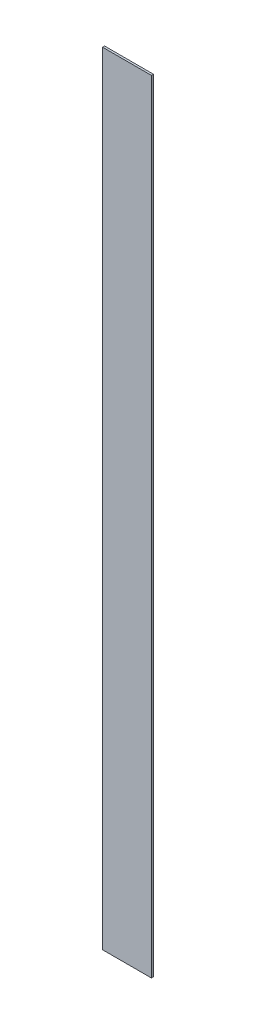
from build123d import *

# Parameters (mm, degrees)
SKETCH1_W           = 1219.2
SKETCH1_H           = 76.2
BOSS_EXTRUDE1_DEPTH = 1.5875


with BuildPart() as part:
    # Sketch1 → Boss-Extrude1 (new, symmetric)
    with BuildSketch(Plane(origin=(0, 0, 0), x_dir=(0, 1, 0), z_dir=(0, 0, 1))):
        Rectangle(SKETCH1_W, SKETCH1_H)
    extrude(amount=BOSS_EXTRUDE1_DEPTH, both=True)


solid = part.part
